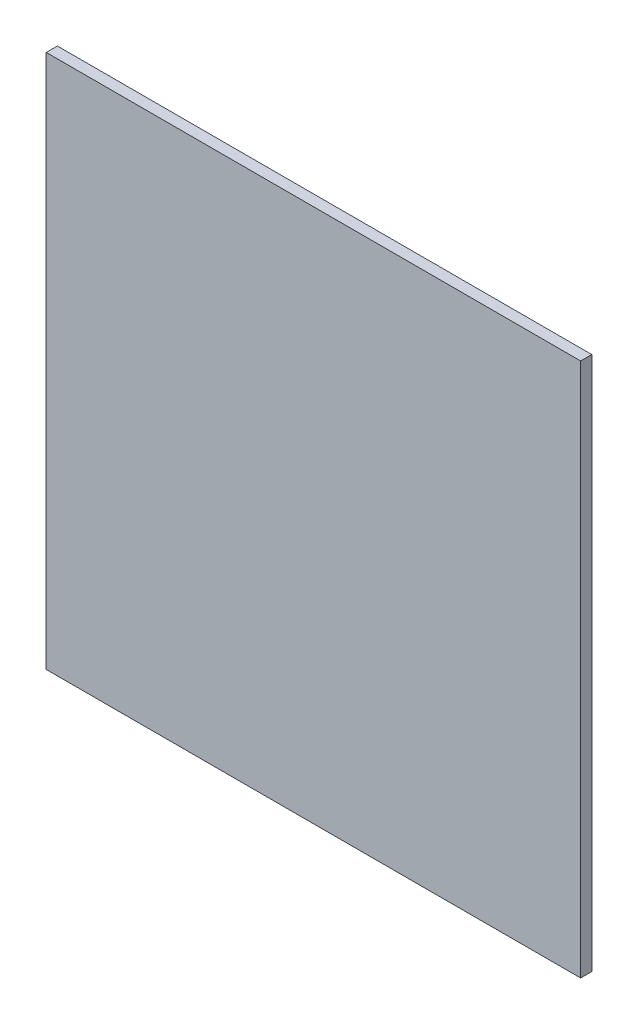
from build123d import *

# Parameters (mm, degrees)
SKETCH1_W          = 304.8
SKETCH1_H          = 304.8
BASE_EXTRUDE_DEPTH = 6.35


with BuildPart() as part:
    # Sketch1 → Base-Extrude (new body)
    with BuildSketch(Plane.XY):
        with Locations((-127, -127)):
            Rectangle(SKETCH1_W, SKETCH1_H)
    extrude(amount=BASE_EXTRUDE_DEPTH)


solid = part.part
